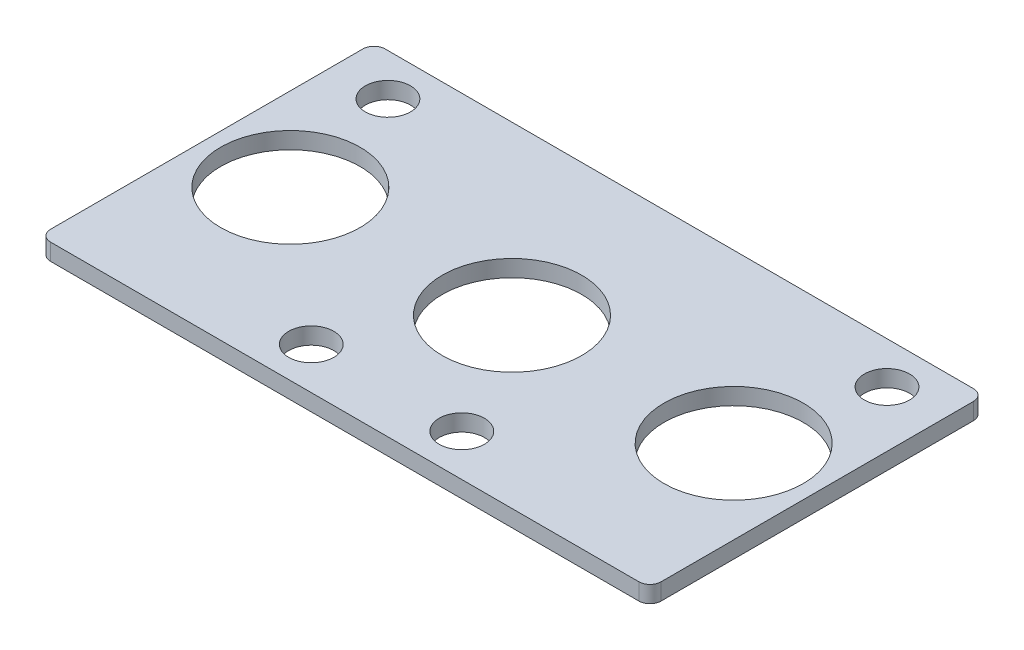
from build123d import *

# Parameters (mm, degrees)
SCHIZZO1_R                   = 4.05
SCHIZZO1_R_2                 = 12.5
ESTRUSIONE_ESTRUSIONE1_DEPTH = 3


with BuildPart() as part:
    # Schizzo1 → Estrusione-Estrusione1 (new body)
    with BuildSketch(Plane(origin=(0, 0, 0), x_dir=(1, 0, 0), z_dir=(0, 1, 0))):
        with BuildLine():
            Line((3102.36975432, 1957.352669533), (2996.871010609, 1957.352669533))
            ThreePointArc((2996.871010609, 1957.352669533), (2995.456797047, 1957.93845597), (2994.871010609, 1959.352669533))
            Line((2994.871010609, 1959.352669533), (2994.871010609, 2015.352669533))
            ThreePointArc((2994.871010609, 2015.352669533), (2995.456797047, 2016.766883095), (2996.871010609, 2017.352669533))
            Line((2996.871010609, 2017.352669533), (3102.36975432, 2017.352669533))
            ThreePointArc((3102.36975432, 2017.352669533), (3103.783967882, 2016.766883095), (3104.36975432, 2015.352669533))
            Line((3104.36975432, 2015.352669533), (3104.36975432, 1959.352669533))
            ThreePointArc((3104.36975432, 1959.352669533), (3103.783967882, 1957.93845597), (3102.36975432, 1957.352669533))
        make_face()
        with Locations(Location((3036.120382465, 1964.852669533, 0), (0, 0, 270))):
            Circle(SCHIZZO1_R, mode=Mode.SUBTRACT)
        with Locations(Location((3063.120382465, 1964.852669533, 0), (0, 0, 270))):
            Circle(SCHIZZO1_R, mode=Mode.SUBTRACT)
        with Locations(Location((3004.871010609, 2009.852669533, 0), (0, 0, 270))):
            Circle(SCHIZZO1_R, mode=Mode.SUBTRACT)
        with Locations(Location((3094.36975432, 2009.852669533, 0), (0, 0, 270))):
            Circle(SCHIZZO1_R, mode=Mode.SUBTRACT)
        with Locations(Location((3049.620382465, 1987.352669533, 0), (0, 0, 270))):
            Circle(SCHIZZO1_R_2, mode=Mode.SUBTRACT)
        with Locations(Location((3009.871010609, 1987.352669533, 0), (0, 0, 270))):
            Circle(SCHIZZO1_R_2, mode=Mode.SUBTRACT)
        with Locations(Location((3089.36975432, 1987.352669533, 0), (0, 0, 270))):
            Circle(SCHIZZO1_R_2, mode=Mode.SUBTRACT)
    extrude(amount=ESTRUSIONE_ESTRUSIONE1_DEPTH)


solid = part.part
